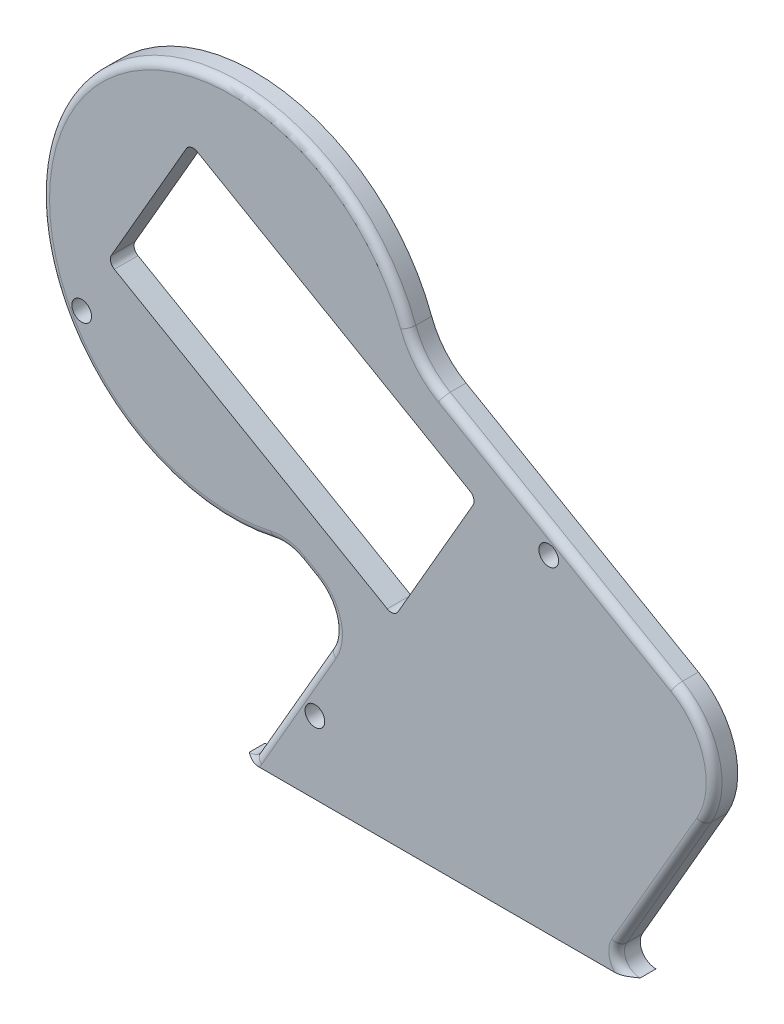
ISO-10303-21;
HEADER;
FILE_DESCRIPTION(('STEP AP214'),'2;1');
FILE_NAME('part.step','',(''),(''),'','','');
FILE_SCHEMA(('AUTOMOTIVE_DESIGN { 1 0 10303 214 1 1 1 1 }'));
ENDSEC;
DATA;
#1=APPLICATION_CONTEXT('core data for automotive mechanical design processes');
#2=APPLICATION_PROTOCOL_DEFINITION('international standard','automotive_design',2000,#1);
#3=PRODUCT_CONTEXT('',#1,'mechanical');
#4=PRODUCT('Part','Part','',(#3));
#5=PRODUCT_RELATED_PRODUCT_CATEGORY('part','',(#4));
#6=PRODUCT_DEFINITION_FORMATION('','',#4);
#7=PRODUCT_DEFINITION_CONTEXT('part definition',#1,'design');
#8=PRODUCT_DEFINITION('design','',#6,#7);
#9=PRODUCT_DEFINITION_SHAPE('','',#8);
#10=(LENGTH_UNIT() NAMED_UNIT(*) SI_UNIT(.MILLI.,.METRE.));
#11=(NAMED_UNIT(*) PLANE_ANGLE_UNIT() SI_UNIT($,.RADIAN.));
#12=(NAMED_UNIT(*) SI_UNIT($,.STERADIAN.) SOLID_ANGLE_UNIT());
#13=UNCERTAINTY_MEASURE_WITH_UNIT(LENGTH_MEASURE(1.E-05),#10,'distance_accuracy_value','');
#14=(GEOMETRIC_REPRESENTATION_CONTEXT(3) GLOBAL_UNCERTAINTY_ASSIGNED_CONTEXT((#13)) GLOBAL_UNIT_ASSIGNED_CONTEXT((#10,
#11,#12)) REPRESENTATION_CONTEXT('',''));
#15=CARTESIAN_POINT('',(0.,0.,0.));
#16=DIRECTION('',(0.,0.,1.));
#17=DIRECTION('',(1.,0.,0.));
#18=AXIS2_PLACEMENT_3D('',#15,#16,#17);
#19=CARTESIAN_POINT('',(6.85782905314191,60.9925358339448,3.));
#20=DIRECTION('',(0.,0.,1.));
#21=DIRECTION('',(1.,0.,0.));
#22=AXIS2_PLACEMENT_3D('',#19,#20,#21);
#23=PLANE('',#22);
#24=CARTESIAN_POINT('',(-43.9149447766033,38.8935845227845,3.));
#25=DIRECTION('',(0.,0.,1.));
#26=DIRECTION('',(1.,0.,0.));
#27=AXIS2_PLACEMENT_3D('',#24,#25,#26);
#28=CIRCLE('',#27,1.24999999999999);
#29=CARTESIAN_POINT('',(-42.6649447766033,38.8935845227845,3.));
#30=VERTEX_POINT('',#29);
#31=EDGE_CURVE('E472',#30,#30,#28,.T.);
#32=ORIENTED_EDGE('',*,*,#31,.F.);
#33=EDGE_LOOP('',(#32));
#34=FACE_BOUND('',#33,.T.);
#35=CARTESIAN_POINT('',(15.3487875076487,41.6565219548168,3.));
#36=DIRECTION('',(0.,0.,1.));
#37=DIRECTION('',(1.,0.,0.));
#38=AXIS2_PLACEMENT_3D('',#35,#36,#37);
#39=CIRCLE('',#38,1.24999999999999);
#40=CARTESIAN_POINT('',(16.5987875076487,41.6565219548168,3.));
#41=VERTEX_POINT('',#40);
#42=EDGE_CURVE('E484',#41,#41,#39,.T.);
#43=ORIENTED_EDGE('',*,*,#42,.F.);
#44=EDGE_LOOP('',(#43));
#45=FACE_BOUND('',#44,.T.);
#46=CARTESIAN_POINT('',(-14.3245735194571,9.16025403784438,3.));
#47=DIRECTION('',(0.,0.,1.));
#48=DIRECTION('',(1.,0.,0.));
#49=AXIS2_PLACEMENT_3D('',#46,#47,#48);
#50=CIRCLE('',#49,1.24999999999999);
#51=CARTESIAN_POINT('',(-13.0745735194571,9.16025403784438,3.));
#52=VERTEX_POINT('',#51);
#53=EDGE_CURVE('E490',#52,#52,#50,.T.);
#54=ORIENTED_EDGE('',*,*,#53,.F.);
#55=EDGE_LOOP('',(#54));
#56=FACE_BOUND('',#55,.T.);
#57=DIRECTION('',(-1.,0.,0.));
#58=VECTOR('',#57,1.);
#59=CARTESIAN_POINT('',(25.9641016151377,0.,3.));
#60=LINE('',#59,#58);
#61=CARTESIAN_POINT('',(23.7280336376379,0.,3.));
#62=VERTEX_POINT('',#61);
#63=CARTESIAN_POINT('',(-21.4186325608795,0.,3.));
#64=VERTEX_POINT('',#63);
#65=EDGE_CURVE('E218',#62,#64,#60,.T.);
#66=ORIENTED_EDGE('',*,*,#65,.F.);
#67=CARTESIAN_POINT('',(25.9641016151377,1.99999999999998,3.));
#68=DIRECTION('',(0.,0.,1.));
#69=DIRECTION('',(1.,0.,0.));
#70=AXIS2_PLACEMENT_3D('',#67,#68,#69);
#71=CIRCLE('',#70,3.);
#72=CARTESIAN_POINT('',(23.3660254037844,3.49999999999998,3.));
#73=VERTEX_POINT('',#72);
#74=EDGE_CURVE('E823',#62,#73,#71,.F.);
#75=ORIENTED_EDGE('',*,*,#74,.T.);
#76=DIRECTION('',(-0.499999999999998,-0.86602540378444,0.));
#77=VECTOR('',#76,1.);
#78=CARTESIAN_POINT('',(44.1339745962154,39.4711431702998,3.));
#79=LINE('',#78,#77);
#80=CARTESIAN_POINT('',(34.1339745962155,22.150635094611,3.));
#81=VERTEX_POINT('',#80);
#82=EDGE_CURVE('E822',#73,#81,#79,.F.);
#83=ORIENTED_EDGE('',*,*,#82,.T.);
#84=CARTESIAN_POINT('',(26.3397459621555,26.650635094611,3.));
#85=DIRECTION('',(0.,0.,1.));
#86=DIRECTION('',(1.,0.,0.));
#87=AXIS2_PLACEMENT_3D('',#84,#85,#86);
#88=CIRCLE('',#87,9.);
#89=CARTESIAN_POINT('',(30.8397459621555,34.4448637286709,3.));
#90=VERTEX_POINT('',#89);
#91=EDGE_CURVE('E842',#81,#90,#88,.T.);
#92=ORIENTED_EDGE('',*,*,#91,.T.);
#93=DIRECTION('',(0.86602540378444,-0.499999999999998,0.));
#94=VECTOR('',#93,1.);
#95=CARTESIAN_POINT('',(1.35782905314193,51.466256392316,3.));
#96=LINE('',#95,#94);
#97=CARTESIAN_POINT('',(1.35782905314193,51.466256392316,3.));
#98=VERTEX_POINT('',#97);
#99=EDGE_CURVE('E840',#90,#98,#96,.F.);
#100=ORIENTED_EDGE('',*,*,#99,.T.);
#101=CARTESIAN_POINT('',(6.85782905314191,60.9925358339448,3.));
#102=DIRECTION('',(0.,0.,1.));
#103=DIRECTION('',(1.,0.,0.));
#104=AXIS2_PLACEMENT_3D('',#101,#102,#103);
#105=CIRCLE('',#104,11.);
#106=CARTESIAN_POINT('',(-3.44911564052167,57.1497645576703,3.));
#107=VERTEX_POINT('',#106);
#108=EDGE_CURVE('E838',#98,#107,#105,.F.);
#109=ORIENTED_EDGE('',*,*,#108,.T.);
#110=CARTESIAN_POINT('',(-25.0000000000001,49.1148791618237,3.));
#111=DIRECTION('',(0.,0.,1.));
#112=DIRECTION('',(1.,0.,0.));
#113=AXIS2_PLACEMENT_3D('',#110,#111,#112);
#114=CIRCLE('',#113,23.);
#115=CARTESIAN_POINT('',(-19.9118612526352,26.6847466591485,3.));
#116=VERTEX_POINT('',#115);
#117=EDGE_CURVE('E824',#107,#116,#114,.T.);
#118=ORIENTED_EDGE('',*,*,#117,.T.);
#119=CARTESIAN_POINT('',(-18.5845207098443,20.8334077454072,3.));
#120=DIRECTION('',(0.,0.,1.));
#121=DIRECTION('',(1.,0.,0.));
#122=AXIS2_PLACEMENT_3D('',#119,#120,#121);
#123=CIRCLE('',#122,6.00000000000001);
#124=CARTESIAN_POINT('',(-15.5845207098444,26.0295601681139,3.));
#125=VERTEX_POINT('',#124);
#126=EDGE_CURVE('E825',#116,#125,#123,.F.);
#127=ORIENTED_EDGE('',*,*,#126,.T.);
#128=DIRECTION('',(-0.866025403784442,0.499999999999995,0.));
#129=VECTOR('',#128,1.);
#130=CARTESIAN_POINT('',(-13.8921709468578,25.0524815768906,3.));
#131=LINE('',#130,#129);
#132=CARTESIAN_POINT('',(-13.8301270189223,25.0166604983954,3.));
#133=VERTEX_POINT('',#132);
#134=EDGE_CURVE('E828',#125,#133,#131,.F.);
#135=ORIENTED_EDGE('',*,*,#134,.T.);
#136=CARTESIAN_POINT('',(-16.8301270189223,19.8205080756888,3.));
#137=DIRECTION('',(0.,0.,1.));
#138=DIRECTION('',(1.,0.,0.));
#139=AXIS2_PLACEMENT_3D('',#136,#137,#138);
#140=CIRCLE('',#139,6.);
#141=CARTESIAN_POINT('',(-11.6339745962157,16.8205080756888,3.));
#142=VERTEX_POINT('',#141);
#143=EDGE_CURVE('E832',#133,#142,#140,.F.);
#144=ORIENTED_EDGE('',*,*,#143,.T.);
#145=DIRECTION('',(0.499999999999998,0.86602540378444,0.));
#146=VECTOR('',#145,1.);
#147=CARTESIAN_POINT('',(12.1160254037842,57.9567147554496,3.));
#148=LINE('',#147,#146);
#149=CARTESIAN_POINT('',(-21.056624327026,0.499999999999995,3.));
#150=VERTEX_POINT('',#149);
#151=EDGE_CURVE('E834',#142,#150,#148,.F.);
#152=ORIENTED_EDGE('',*,*,#151,.T.);
#153=CARTESIAN_POINT('',(-23.6547005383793,1.99999999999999,3.));
#154=DIRECTION('',(0.,0.,1.));
#155=DIRECTION('',(1.,0.,0.));
#156=AXIS2_PLACEMENT_3D('',#153,#154,#155);
#157=CIRCLE('',#156,3.);
#158=EDGE_CURVE('E836',#150,#64,#157,.F.);
#159=ORIENTED_EDGE('',*,*,#158,.T.);
#160=EDGE_LOOP('',(#66,#75,#83,#92,#100,#109,#118,#127,#135,#144,#152,#159));
#161=FACE_BOUND('',#160,.T.);
#162=DIRECTION('',(0.866025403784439,-0.5,0.));
#163=VECTOR('',#162,1.);
#164=CARTESIAN_POINT('',(-0.9998044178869,47.3827154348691,3.));
#165=LINE('',#164,#163);
#166=CARTESIAN_POINT('',(-29.2762794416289,63.7081459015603,3.));
#167=VERTEX_POINT('',#166);
#168=CARTESIAN_POINT('',(5.36473670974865,43.7081459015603,3.));
#169=VERTEX_POINT('',#168);
#170=EDGE_CURVE('E478',#167,#169,#165,.T.);
#171=ORIENTED_EDGE('',*,*,#170,.T.);
#172=CARTESIAN_POINT('',(4.86473670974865,42.8421204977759,3.));
#173=DIRECTION('',(0.,0.,1.));
#174=DIRECTION('',(1.,0.,0.));
#175=AXIS2_PLACEMENT_3D('',#172,#173,#174);
#176=CIRCLE('',#175,1.);
#177=CARTESIAN_POINT('',(5.73076211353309,42.3421204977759,3.));
#178=VERTEX_POINT('',#177);
#179=EDGE_CURVE('E450',#169,#178,#176,.F.);
#180=ORIENTED_EDGE('',*,*,#179,.T.);
#181=DIRECTION('',(-0.5,-0.866025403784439,0.));
#182=VECTOR('',#181,1.);
#183=CARTESIAN_POINT('',(14.0883955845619,56.817966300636,3.));
#184=LINE('',#183,#182);
#185=CARTESIAN_POINT('',(-3.76923788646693,25.8876378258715,3.));
#186=VERTEX_POINT('',#185);
#187=EDGE_CURVE('E473',#178,#186,#184,.T.);
#188=ORIENTED_EDGE('',*,*,#187,.T.);
#189=CARTESIAN_POINT('',(-4.63526329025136,26.3876378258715,3.));
#190=DIRECTION('',(0.,0.,1.));
#191=DIRECTION('',(1.,0.,0.));
#192=AXIS2_PLACEMENT_3D('',#189,#190,#191);
#193=CIRCLE('',#192,1.);
#194=CARTESIAN_POINT('',(-5.13526329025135,25.5216124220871,3.));
#195=VERTEX_POINT('',#194);
#196=EDGE_CURVE('E11',#186,#195,#193,.F.);
#197=ORIENTED_EDGE('',*,*,#196,.T.);
#198=DIRECTION('',(-0.866025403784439,0.5,0.));
#199=VECTOR('',#198,1.);
#200=CARTESIAN_POINT('',(-11.4998044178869,29.1961819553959,3.));
#201=LINE('',#200,#199);
#202=CARTESIAN_POINT('',(-39.7762794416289,45.5216124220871,3.));
#203=VERTEX_POINT('',#202);
#204=EDGE_CURVE('E471',#195,#203,#201,.T.);
#205=ORIENTED_EDGE('',*,*,#204,.T.);
#206=CARTESIAN_POINT('',(-39.2762794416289,46.3876378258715,3.));
#207=DIRECTION('',(0.,0.,1.));
#208=DIRECTION('',(1.,0.,0.));
#209=AXIS2_PLACEMENT_3D('',#206,#207,#208);
#210=CIRCLE('',#209,1.);
#211=CARTESIAN_POINT('',(-40.1423048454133,46.8876378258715,3.));
#212=VERTEX_POINT('',#211);
#213=EDGE_CURVE('E454',#203,#212,#210,.F.);
#214=ORIENTED_EDGE('',*,*,#213,.T.);
#215=DIRECTION('',(0.5,0.866025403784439,0.));
#216=VECTOR('',#215,1.);
#217=CARTESIAN_POINT('',(-22.2846713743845,77.817966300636,3.));
#218=LINE('',#217,#216);
#219=CARTESIAN_POINT('',(-30.6423048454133,63.3421204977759,3.));
#220=VERTEX_POINT('',#219);
#221=EDGE_CURVE('E513',#212,#220,#218,.T.);
#222=ORIENTED_EDGE('',*,*,#221,.T.);
#223=CARTESIAN_POINT('',(-29.7762794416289,62.8421204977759,3.));
#224=DIRECTION('',(0.,0.,1.));
#225=DIRECTION('',(1.,0.,0.));
#226=AXIS2_PLACEMENT_3D('',#223,#224,#225);
#227=CIRCLE('',#226,1.);
#228=EDGE_CURVE('E446',#220,#167,#227,.F.);
#229=ORIENTED_EDGE('',*,*,#228,.T.);
#230=EDGE_LOOP('',(#171,#180,#188,#197,#205,#214,#222,#229));
#231=FACE_BOUND('',#230,.T.);
#232=ADVANCED_FACE('F34',(#34,#45,#56,#161,#231),#23,.T.);
#233=CARTESIAN_POINT('',(6.85782905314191,60.9925358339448,0.));
#234=DIRECTION('',(0.,0.,1.));
#235=DIRECTION('',(1.,0.,0.));
#236=AXIS2_PLACEMENT_3D('',#233,#234,#235);
#237=PLANE('',#236);
#238=CARTESIAN_POINT('',(6.85782905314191,60.9925358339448,0.));
#239=DIRECTION('',(0.,0.,1.));
#240=DIRECTION('',(1.,0.,0.));
#241=AXIS2_PLACEMENT_3D('',#238,#239,#240);
#242=CIRCLE('',#241,10.);
#243=CARTESIAN_POINT('',(-2.51212066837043,57.499107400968,0.));
#244=VERTEX_POINT('',#243);
#245=CARTESIAN_POINT('',(1.85782905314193,52.3322817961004,0.));
#246=VERTEX_POINT('',#245);
#247=EDGE_CURVE('E212',#244,#246,#242,.T.);
#248=ORIENTED_EDGE('',*,*,#247,.T.);
#249=DIRECTION('',(0.86602540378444,-0.499999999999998,0.));
#250=VECTOR('',#249,1.);
#251=CARTESIAN_POINT('',(1.85782905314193,52.3322817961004,0.));
#252=LINE('',#251,#250);
#253=CARTESIAN_POINT('',(31.3397459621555,35.3108891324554,0.));
#254=VERTEX_POINT('',#253);
#255=EDGE_CURVE('E221',#246,#254,#252,.T.);
#256=ORIENTED_EDGE('',*,*,#255,.T.);
#257=CARTESIAN_POINT('',(26.3397459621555,26.650635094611,0.));
#258=DIRECTION('',(0.,0.,1.));
#259=DIRECTION('',(1.,0.,0.));
#260=AXIS2_PLACEMENT_3D('',#257,#258,#259);
#261=CIRCLE('',#260,10.);
#262=CARTESIAN_POINT('',(34.9999999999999,21.650635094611,0.));
#263=VERTEX_POINT('',#262);
#264=EDGE_CURVE('E227',#263,#254,#261,.T.);
#265=ORIENTED_EDGE('',*,*,#264,.F.);
#266=DIRECTION('',(-0.499999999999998,-0.86602540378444,0.));
#267=VECTOR('',#266,1.);
#268=CARTESIAN_POINT('',(34.9999999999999,21.650635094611,0.));
#269=LINE('',#268,#267);
#270=CARTESIAN_POINT('',(24.2320508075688,2.99999999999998,0.));
#271=VERTEX_POINT('',#270);
#272=EDGE_CURVE('E244',#263,#271,#269,.T.);
#273=ORIENTED_EDGE('',*,*,#272,.T.);
#274=CARTESIAN_POINT('',(25.9641016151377,1.99999999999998,0.));
#275=DIRECTION('',(0.,0.,1.));
#276=DIRECTION('',(1.,0.,0.));
#277=AXIS2_PLACEMENT_3D('',#274,#275,#276);
#278=CIRCLE('',#277,2.);
#279=CARTESIAN_POINT('',(25.9641016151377,0.,0.));
#280=VERTEX_POINT('',#279);
#281=EDGE_CURVE('E247',#271,#280,#278,.T.);
#282=ORIENTED_EDGE('',*,*,#281,.T.);
#283=DIRECTION('',(-1.,0.,0.));
#284=VECTOR('',#283,1.);
#285=CARTESIAN_POINT('',(25.9641016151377,0.,0.));
#286=LINE('',#285,#284);
#287=CARTESIAN_POINT('',(-23.6547005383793,0.,0.));
#288=VERTEX_POINT('',#287);
#289=EDGE_CURVE('E250',#280,#288,#286,.T.);
#290=ORIENTED_EDGE('',*,*,#289,.T.);
#291=CARTESIAN_POINT('',(-23.6547005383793,1.99999999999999,0.));
#292=DIRECTION('',(0.,0.,1.));
#293=DIRECTION('',(1.,0.,0.));
#294=AXIS2_PLACEMENT_3D('',#291,#292,#293);
#295=CIRCLE('',#294,2.);
#296=CARTESIAN_POINT('',(-21.9226497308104,0.999999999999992,0.));
#297=VERTEX_POINT('',#296);
#298=EDGE_CURVE('E253',#288,#297,#295,.T.);
#299=ORIENTED_EDGE('',*,*,#298,.T.);
#300=DIRECTION('',(0.499999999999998,0.86602540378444,0.));
#301=VECTOR('',#300,1.);
#302=CARTESIAN_POINT('',(-21.9226497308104,0.999999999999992,0.));
#303=LINE('',#302,#301);
#304=CARTESIAN_POINT('',(-12.5000000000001,17.3205080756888,0.));
#305=VERTEX_POINT('',#304);
#306=EDGE_CURVE('E256',#297,#305,#303,.T.);
#307=ORIENTED_EDGE('',*,*,#306,.T.);
#308=CARTESIAN_POINT('',(-16.8301270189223,19.8205080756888,0.));
#309=DIRECTION('',(0.,0.,1.));
#310=DIRECTION('',(1.,0.,0.));
#311=AXIS2_PLACEMENT_3D('',#308,#309,#310);
#312=CIRCLE('',#311,5.);
#313=CARTESIAN_POINT('',(-14.3301270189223,24.150635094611,0.));
#314=VERTEX_POINT('',#313);
#315=EDGE_CURVE('E259',#305,#314,#312,.T.);
#316=ORIENTED_EDGE('',*,*,#315,.T.);
#317=DIRECTION('',(-0.866025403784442,0.499999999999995,0.));
#318=VECTOR('',#317,1.);
#319=CARTESIAN_POINT('',(-14.3301270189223,24.150635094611,0.));
#320=LINE('',#319,#318);
#321=CARTESIAN_POINT('',(-16.0845207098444,25.1635347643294,0.));
#322=VERTEX_POINT('',#321);
#323=EDGE_CURVE('E262',#314,#322,#320,.T.);
#324=ORIENTED_EDGE('',*,*,#323,.T.);
#325=CARTESIAN_POINT('',(-18.5845207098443,20.8334077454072,0.));
#326=DIRECTION('',(0.,0.,1.));
#327=DIRECTION('',(1.,0.,0.));
#328=AXIS2_PLACEMENT_3D('',#325,#326,#327);
#329=CIRCLE('',#328,5.00000000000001);
#330=CARTESIAN_POINT('',(-19.6906378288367,25.7095235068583,0.));
#331=VERTEX_POINT('',#330);
#332=EDGE_CURVE('E265',#322,#331,#329,.T.);
#333=ORIENTED_EDGE('',*,*,#332,.T.);
#334=CARTESIAN_POINT('',(-25.0000000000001,49.1148791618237,0.));
#335=DIRECTION('',(0.,0.,1.));
#336=DIRECTION('',(1.,0.,0.));
#337=AXIS2_PLACEMENT_3D('',#334,#335,#336);
#338=CIRCLE('',#337,24.);
#339=EDGE_CURVE('E234',#244,#331,#338,.T.);
#340=ORIENTED_EDGE('',*,*,#339,.F.);
#341=EDGE_LOOP('',(#248,#256,#265,#273,#282,#290,#299,#307,#316,#324,#333,#340));
#342=FACE_BOUND('',#341,.T.);
#343=CARTESIAN_POINT('',(-14.3245735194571,9.16025403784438,0.));
#344=DIRECTION('',(0.,0.,1.));
#345=DIRECTION('',(1.,0.,0.));
#346=AXIS2_PLACEMENT_3D('',#343,#344,#345);
#347=CIRCLE('',#346,1.24999999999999);
#348=CARTESIAN_POINT('',(-13.0745735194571,9.16025403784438,0.));
#349=VERTEX_POINT('',#348);
#350=EDGE_CURVE('E403',#349,#349,#347,.T.);
#351=ORIENTED_EDGE('',*,*,#350,.T.);
#352=EDGE_LOOP('',(#351));
#353=FACE_BOUND('',#352,.T.);
#354=CARTESIAN_POINT('',(15.3487875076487,41.6565219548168,0.));
#355=DIRECTION('',(0.,0.,1.));
#356=DIRECTION('',(1.,0.,0.));
#357=AXIS2_PLACEMENT_3D('',#354,#355,#356);
#358=CIRCLE('',#357,1.24999999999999);
#359=CARTESIAN_POINT('',(16.5987875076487,41.6565219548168,0.));
#360=VERTEX_POINT('',#359);
#361=EDGE_CURVE('E487',#360,#360,#358,.T.);
#362=ORIENTED_EDGE('',*,*,#361,.T.);
#363=EDGE_LOOP('',(#362));
#364=FACE_BOUND('',#363,.T.);
#365=CARTESIAN_POINT('',(-43.9149447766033,38.8935845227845,0.));
#366=DIRECTION('',(0.,0.,1.));
#367=DIRECTION('',(1.,0.,0.));
#368=AXIS2_PLACEMENT_3D('',#365,#366,#367);
#369=CIRCLE('',#368,1.24999999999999);
#370=CARTESIAN_POINT('',(-42.6649447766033,38.8935845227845,0.));
#371=VERTEX_POINT('',#370);
#372=EDGE_CURVE('E476',#371,#371,#369,.T.);
#373=ORIENTED_EDGE('',*,*,#372,.T.);
#374=EDGE_LOOP('',(#373));
#375=FACE_BOUND('',#374,.T.);
#376=DIRECTION('',(-0.5,-0.866025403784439,0.));
#377=VECTOR('',#376,1.);
#378=CARTESIAN_POINT('',(-22.2846713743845,77.817966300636,0.));
#379=LINE('',#378,#377);
#380=CARTESIAN_POINT('',(-30.6423048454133,63.3421204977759,0.));
#381=VERTEX_POINT('',#380);
#382=CARTESIAN_POINT('',(-40.1423048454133,46.8876378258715,0.));
#383=VERTEX_POINT('',#382);
#384=EDGE_CURVE('E518',#381,#383,#379,.T.);
#385=ORIENTED_EDGE('',*,*,#384,.T.);
#386=CARTESIAN_POINT('',(-39.2762794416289,46.3876378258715,0.));
#387=DIRECTION('',(0.,0.,1.));
#388=DIRECTION('',(1.,0.,0.));
#389=AXIS2_PLACEMENT_3D('',#386,#387,#388);
#390=CIRCLE('',#389,1.);
#391=CARTESIAN_POINT('',(-39.7762794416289,45.5216124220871,0.));
#392=VERTEX_POINT('',#391);
#393=EDGE_CURVE('E452',#383,#392,#390,.T.);
#394=ORIENTED_EDGE('',*,*,#393,.T.);
#395=DIRECTION('',(0.866025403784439,-0.5,0.));
#396=VECTOR('',#395,1.);
#397=CARTESIAN_POINT('',(-11.4998044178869,29.1961819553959,0.));
#398=LINE('',#397,#396);
#399=CARTESIAN_POINT('',(-5.13526329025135,25.5216124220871,0.));
#400=VERTEX_POINT('',#399);
#401=EDGE_CURVE('E461',#392,#400,#398,.T.);
#402=ORIENTED_EDGE('',*,*,#401,.T.);
#403=CARTESIAN_POINT('',(-4.63526329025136,26.3876378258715,0.));
#404=DIRECTION('',(0.,0.,1.));
#405=DIRECTION('',(1.,0.,0.));
#406=AXIS2_PLACEMENT_3D('',#403,#404,#405);
#407=CIRCLE('',#406,1.);
#408=CARTESIAN_POINT('',(-3.76923788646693,25.8876378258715,0.));
#409=VERTEX_POINT('',#408);
#410=EDGE_CURVE('E42',#400,#409,#407,.T.);
#411=ORIENTED_EDGE('',*,*,#410,.T.);
#412=DIRECTION('',(0.5,0.866025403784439,0.));
#413=VECTOR('',#412,1.);
#414=CARTESIAN_POINT('',(14.0883955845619,56.817966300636,0.));
#415=LINE('',#414,#413);
#416=CARTESIAN_POINT('',(5.73076211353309,42.3421204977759,0.));
#417=VERTEX_POINT('',#416);
#418=EDGE_CURVE('E460',#409,#417,#415,.T.);
#419=ORIENTED_EDGE('',*,*,#418,.T.);
#420=CARTESIAN_POINT('',(4.86473670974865,42.8421204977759,0.));
#421=DIRECTION('',(0.,0.,1.));
#422=DIRECTION('',(1.,0.,0.));
#423=AXIS2_PLACEMENT_3D('',#420,#421,#422);
#424=CIRCLE('',#423,1.);
#425=CARTESIAN_POINT('',(5.36473670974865,43.7081459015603,0.));
#426=VERTEX_POINT('',#425);
#427=EDGE_CURVE('E448',#417,#426,#424,.T.);
#428=ORIENTED_EDGE('',*,*,#427,.T.);
#429=DIRECTION('',(-0.866025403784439,0.5,0.));
#430=VECTOR('',#429,1.);
#431=CARTESIAN_POINT('',(-0.9998044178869,47.3827154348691,0.));
#432=LINE('',#431,#430);
#433=CARTESIAN_POINT('',(-29.2762794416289,63.7081459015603,0.));
#434=VERTEX_POINT('',#433);
#435=EDGE_CURVE('E468',#426,#434,#432,.T.);
#436=ORIENTED_EDGE('',*,*,#435,.T.);
#437=CARTESIAN_POINT('',(-29.7762794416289,62.8421204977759,0.));
#438=DIRECTION('',(0.,0.,1.));
#439=DIRECTION('',(1.,0.,0.));
#440=AXIS2_PLACEMENT_3D('',#437,#438,#439);
#441=CIRCLE('',#440,1.);
#442=EDGE_CURVE('E444',#434,#381,#441,.T.);
#443=ORIENTED_EDGE('',*,*,#442,.T.);
#444=EDGE_LOOP('',(#385,#394,#402,#411,#419,#428,#436,#443));
#445=FACE_BOUND('',#444,.T.);
#446=ADVANCED_FACE('F230',(#342,#353,#364,#375,#445),#237,.F.);
#447=CARTESIAN_POINT('',(6.85782905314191,60.9925358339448,3.));
#448=DIRECTION('',(0.,0.,-1.));
#449=DIRECTION('',(-1.,0.,0.));
#450=AXIS2_PLACEMENT_3D('',#447,#448,#449);
#451=CYLINDRICAL_SURFACE('',#450,10.);
#452=DIRECTION('',(0.,0.,-1.));
#453=VECTOR('',#452,1.);
#454=CARTESIAN_POINT('',(-2.51212066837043,57.499107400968,3.));
#455=LINE('',#454,#453);
#456=CARTESIAN_POINT('',(-2.51212066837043,57.499107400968,2.));
#457=VERTEX_POINT('',#456);
#458=EDGE_CURVE('E268',#457,#244,#455,.T.);
#459=ORIENTED_EDGE('',*,*,#458,.F.);
#460=CARTESIAN_POINT('',(6.85782905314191,60.9925358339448,2.));
#461=DIRECTION('',(0.,0.,1.));
#462=DIRECTION('',(1.,0.,0.));
#463=AXIS2_PLACEMENT_3D('',#460,#461,#462);
#464=CIRCLE('',#463,10.);
#465=CARTESIAN_POINT('',(1.85782905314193,52.3322817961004,2.));
#466=VERTEX_POINT('',#465);
#467=EDGE_CURVE('E214',#457,#466,#464,.T.);
#468=ORIENTED_EDGE('',*,*,#467,.T.);
#469=DIRECTION('',(0.,0.,-1.));
#470=VECTOR('',#469,1.);
#471=CARTESIAN_POINT('',(1.85782905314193,52.3322817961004,3.));
#472=LINE('',#471,#470);
#473=EDGE_CURVE('E207',#466,#246,#472,.T.);
#474=ORIENTED_EDGE('',*,*,#473,.T.);
#475=ORIENTED_EDGE('',*,*,#247,.F.);
#476=EDGE_LOOP('',(#459,#468,#474,#475));
#477=FACE_BOUND('',#476,.T.);
#478=ADVANCED_FACE('F210',(#477),#451,.F.);
#479=CARTESIAN_POINT('',(-25.0000000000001,49.1148791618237,3.));
#480=DIRECTION('',(0.,0.,-1.));
#481=DIRECTION('',(-1.,0.,0.));
#482=AXIS2_PLACEMENT_3D('',#479,#480,#481);
#483=CYLINDRICAL_SURFACE('',#482,24.);
#484=DIRECTION('',(0.,0.,-1.));
#485=VECTOR('',#484,1.);
#486=CARTESIAN_POINT('',(-19.6906378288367,25.7095235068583,3.));
#487=LINE('',#486,#485);
#488=CARTESIAN_POINT('',(-19.6906378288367,25.7095235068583,2.));
#489=VERTEX_POINT('',#488);
#490=EDGE_CURVE('E271',#489,#331,#487,.T.);
#491=ORIENTED_EDGE('',*,*,#490,.F.);
#492=CARTESIAN_POINT('',(-25.0000000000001,49.1148791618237,2.));
#493=DIRECTION('',(0.,0.,1.));
#494=DIRECTION('',(1.,0.,0.));
#495=AXIS2_PLACEMENT_3D('',#492,#493,#494);
#496=CIRCLE('',#495,24.);
#497=EDGE_CURVE('E396',#489,#457,#496,.F.);
#498=ORIENTED_EDGE('',*,*,#497,.T.);
#499=ORIENTED_EDGE('',*,*,#458,.T.);
#500=ORIENTED_EDGE('',*,*,#339,.T.);
#501=EDGE_LOOP('',(#491,#498,#499,#500));
#502=FACE_BOUND('',#501,.T.);
#503=ADVANCED_FACE('F346',(#502),#483,.T.);
#504=CARTESIAN_POINT('',(-18.5845207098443,20.8334077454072,3.));
#505=DIRECTION('',(0.,0.,-1.));
#506=DIRECTION('',(-1.,0.,0.));
#507=AXIS2_PLACEMENT_3D('',#504,#505,#506);
#508=CYLINDRICAL_SURFACE('',#507,5.00000000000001);
#509=DIRECTION('',(0.,0.,-1.));
#510=VECTOR('',#509,1.);
#511=CARTESIAN_POINT('',(-16.0845207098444,25.1635347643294,3.));
#512=LINE('',#511,#510);
#513=CARTESIAN_POINT('',(-16.0845207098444,25.1635347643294,2.));
#514=VERTEX_POINT('',#513);
#515=EDGE_CURVE('E273',#514,#322,#512,.T.);
#516=ORIENTED_EDGE('',*,*,#515,.F.);
#517=CARTESIAN_POINT('',(-18.5845207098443,20.8334077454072,2.));
#518=DIRECTION('',(0.,0.,1.));
#519=DIRECTION('',(1.,0.,0.));
#520=AXIS2_PLACEMENT_3D('',#517,#518,#519);
#521=CIRCLE('',#520,5.00000000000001);
#522=EDGE_CURVE('E394',#514,#489,#521,.T.);
#523=ORIENTED_EDGE('',*,*,#522,.T.);
#524=ORIENTED_EDGE('',*,*,#490,.T.);
#525=ORIENTED_EDGE('',*,*,#332,.F.);
#526=EDGE_LOOP('',(#516,#523,#524,#525));
#527=FACE_BOUND('',#526,.T.);
#528=ADVANCED_FACE('F349',(#527),#508,.F.);
#529=CARTESIAN_POINT('',(-14.3301270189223,24.150635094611,3.));
#530=DIRECTION('',(-0.499999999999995,-0.866025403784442,0.));
#531=DIRECTION('',(0.866025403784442,-0.499999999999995,0.));
#532=AXIS2_PLACEMENT_3D('',#529,#530,#531);
#533=PLANE('',#532);
#534=DIRECTION('',(0.,0.,-1.));
#535=VECTOR('',#534,1.);
#536=CARTESIAN_POINT('',(-14.3301270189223,24.150635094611,3.));
#537=LINE('',#536,#535);
#538=CARTESIAN_POINT('',(-14.3301270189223,24.150635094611,2.));
#539=VERTEX_POINT('',#538);
#540=EDGE_CURVE('E275',#539,#314,#537,.T.);
#541=ORIENTED_EDGE('',*,*,#540,.F.);
#542=DIRECTION('',(-0.866025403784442,0.499999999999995,0.));
#543=VECTOR('',#542,1.);
#544=CARTESIAN_POINT('',(-14.3301270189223,24.150635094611,2.));
#545=LINE('',#544,#543);
#546=EDGE_CURVE('E392',#539,#514,#545,.T.);
#547=ORIENTED_EDGE('',*,*,#546,.T.);
#548=ORIENTED_EDGE('',*,*,#515,.T.);
#549=ORIENTED_EDGE('',*,*,#323,.F.);
#550=EDGE_LOOP('',(#541,#547,#548,#549));
#551=FACE_BOUND('',#550,.T.);
#552=ADVANCED_FACE('F353',(#551),#533,.T.);
#553=CARTESIAN_POINT('',(-16.8301270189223,19.8205080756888,3.));
#554=DIRECTION('',(0.,0.,-1.));
#555=DIRECTION('',(-1.,0.,0.));
#556=AXIS2_PLACEMENT_3D('',#553,#554,#555);
#557=CYLINDRICAL_SURFACE('',#556,5.);
#558=DIRECTION('',(0.,0.,-1.));
#559=VECTOR('',#558,1.);
#560=CARTESIAN_POINT('',(-12.5000000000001,17.3205080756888,3.));
#561=LINE('',#560,#559);
#562=CARTESIAN_POINT('',(-12.5000000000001,17.3205080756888,2.));
#563=VERTEX_POINT('',#562);
#564=EDGE_CURVE('E277',#563,#305,#561,.T.);
#565=ORIENTED_EDGE('',*,*,#564,.F.);
#566=CARTESIAN_POINT('',(-16.8301270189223,19.8205080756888,2.));
#567=DIRECTION('',(0.,0.,1.));
#568=DIRECTION('',(1.,0.,0.));
#569=AXIS2_PLACEMENT_3D('',#566,#567,#568);
#570=CIRCLE('',#569,5.);
#571=EDGE_CURVE('E385',#563,#539,#570,.T.);
#572=ORIENTED_EDGE('',*,*,#571,.T.);
#573=ORIENTED_EDGE('',*,*,#540,.T.);
#574=ORIENTED_EDGE('',*,*,#315,.F.);
#575=EDGE_LOOP('',(#565,#572,#573,#574));
#576=FACE_BOUND('',#575,.T.);
#577=ADVANCED_FACE('F357',(#576),#557,.F.);
#578=CARTESIAN_POINT('',(-21.9226497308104,0.999999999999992,3.));
#579=DIRECTION('',(-0.86602540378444,0.499999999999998,0.));
#580=DIRECTION('',(-0.499999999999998,-0.86602540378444,0.));
#581=AXIS2_PLACEMENT_3D('',#578,#579,#580);
#582=PLANE('',#581);
#583=DIRECTION('',(0.,0.,-1.));
#584=VECTOR('',#583,1.);
#585=CARTESIAN_POINT('',(-21.9226497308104,0.999999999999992,3.));
#586=LINE('',#585,#584);
#587=CARTESIAN_POINT('',(-21.9226497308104,0.999999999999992,2.));
#588=VERTEX_POINT('',#587);
#589=EDGE_CURVE('E279',#588,#297,#586,.T.);
#590=ORIENTED_EDGE('',*,*,#589,.F.);
#591=DIRECTION('',(0.499999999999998,0.86602540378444,0.));
#592=VECTOR('',#591,1.);
#593=CARTESIAN_POINT('',(-21.9226497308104,0.999999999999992,2.));
#594=LINE('',#593,#592);
#595=EDGE_CURVE('E383',#588,#563,#594,.T.);
#596=ORIENTED_EDGE('',*,*,#595,.T.);
#597=ORIENTED_EDGE('',*,*,#564,.T.);
#598=ORIENTED_EDGE('',*,*,#306,.F.);
#599=EDGE_LOOP('',(#590,#596,#597,#598));
#600=FACE_BOUND('',#599,.T.);
#601=ADVANCED_FACE('F361',(#600),#582,.T.);
#602=CARTESIAN_POINT('',(-23.6547005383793,1.99999999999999,3.));
#603=DIRECTION('',(0.,0.,-1.));
#604=DIRECTION('',(-1.,0.,0.));
#605=AXIS2_PLACEMENT_3D('',#602,#603,#604);
#606=CYLINDRICAL_SURFACE('',#605,2.);
#607=DIRECTION('',(0.,0.,-1.));
#608=VECTOR('',#607,1.);
#609=CARTESIAN_POINT('',(-23.6547005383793,0.,3.));
#610=LINE('',#609,#608);
#611=CARTESIAN_POINT('',(-23.6547005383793,0.,2.));
#612=VERTEX_POINT('',#611);
#613=EDGE_CURVE('E281',#612,#288,#610,.T.);
#614=ORIENTED_EDGE('',*,*,#613,.F.);
#615=CARTESIAN_POINT('',(-23.6547005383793,1.99999999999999,2.));
#616=DIRECTION('',(0.,0.,1.));
#617=DIRECTION('',(1.,0.,0.));
#618=AXIS2_PLACEMENT_3D('',#615,#616,#617);
#619=CIRCLE('',#618,2.);
#620=EDGE_CURVE('E376',#612,#588,#619,.T.);
#621=ORIENTED_EDGE('',*,*,#620,.T.);
#622=ORIENTED_EDGE('',*,*,#589,.T.);
#623=ORIENTED_EDGE('',*,*,#298,.F.);
#624=EDGE_LOOP('',(#614,#621,#622,#623));
#625=FACE_BOUND('',#624,.T.);
#626=ADVANCED_FACE('F364',(#625),#606,.F.);
#627=CARTESIAN_POINT('',(25.9641016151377,0.,3.));
#628=DIRECTION('',(0.,-1.,0.));
#629=DIRECTION('',(1.,0.,0.));
#630=AXIS2_PLACEMENT_3D('',#627,#628,#629);
#631=PLANE('',#630);
#632=DIRECTION('',(0.,0.,-1.));
#633=VECTOR('',#632,1.);
#634=CARTESIAN_POINT('',(25.9641016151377,0.,3.));
#635=LINE('',#634,#633);
#636=CARTESIAN_POINT('',(25.9641016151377,0.,2.));
#637=VERTEX_POINT('',#636);
#638=EDGE_CURVE('E283',#637,#280,#635,.T.);
#639=ORIENTED_EDGE('',*,*,#638,.F.);
#640=CARTESIAN_POINT('',(23.7280336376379,0.,3.));
#641=CARTESIAN_POINT('',(23.7874297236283,0.,2.9999948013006));
#642=CARTESIAN_POINT('',(23.8467548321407,0.,2.99706185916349));
#643=CARTESIAN_POINT('',(23.9648017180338,0.,2.98595676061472));
#644=CARTESIAN_POINT('',(24.023524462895,0.,2.97779506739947));
#645=CARTESIAN_POINT('',(24.1964997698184,0.,2.94671957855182));
#646=CARTESIAN_POINT('',(24.3095697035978,0.,2.9171718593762));
#647=CARTESIAN_POINT('',(24.5415615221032,0.,2.84098297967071));
#648=CARTESIAN_POINT('',(24.6600167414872,0.,2.79298303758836));
#649=CARTESIAN_POINT('',(24.8915203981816,0.,2.68520855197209));
#650=CARTESIAN_POINT('',(25.0045604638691,0.,2.62541646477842));
#651=CARTESIAN_POINT('',(25.3386264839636,0.,2.4332215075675));
#652=CARTESIAN_POINT('',(25.552541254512,0.,2.28882249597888));
#653=CARTESIAN_POINT('',(25.8282484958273,0.,2.09603907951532));
#654=CARTESIAN_POINT('',(25.8925223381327,0.,2.05061333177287));
#655=CARTESIAN_POINT('',(25.9592329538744,0.,2.00344266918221));
#656=CARTESIAN_POINT('',(25.9616672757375,0.,2.00172134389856));
#657=CARTESIAN_POINT('',(25.9641016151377,0.,2.));
#658=B_SPLINE_CURVE_WITH_KNOTS('',3,(#640,#641,#642,#643,#644,#645,#646,#647,#648,#649,#650,
#651,#652,#653,#654,#655,#656,#657),.UNSPECIFIED.,.F.,.F.,(4,2,2,2,2,2,2,2,4),(0.,
0.178006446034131,0.355657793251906,0.705002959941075,1.08758379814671,1.470738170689,
2.24361312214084,2.47977972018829,2.48872399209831),.UNSPECIFIED.);
#659=EDGE_CURVE('E299',#637,#62,#658,.F.);
#660=ORIENTED_EDGE('',*,*,#659,.T.);
#661=ORIENTED_EDGE('',*,*,#65,.T.);
#662=CARTESIAN_POINT('',(-21.4186325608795,0.,3.));
#663=CARTESIAN_POINT('',(-21.4780286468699,0.,2.9999948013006));
#664=CARTESIAN_POINT('',(-21.5373537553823,0.,2.9970618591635));
#665=CARTESIAN_POINT('',(-21.6554006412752,0.,2.98595676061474));
#666=CARTESIAN_POINT('',(-21.7141233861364,0.,2.9777950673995));
#667=CARTESIAN_POINT('',(-21.8870986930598,0.,2.94671957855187));
#668=CARTESIAN_POINT('',(-22.0001686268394,0.,2.91717185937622));
#669=CARTESIAN_POINT('',(-22.2321604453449,0.,2.84098297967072));
#670=CARTESIAN_POINT('',(-22.3506156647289,0.,2.79298303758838));
#671=CARTESIAN_POINT('',(-22.5821193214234,0.,2.68520855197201));
#672=CARTESIAN_POINT('',(-22.6951593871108,0.,2.62541646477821));
#673=CARTESIAN_POINT('',(-23.0292254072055,0.,2.43322150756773));
#674=CARTESIAN_POINT('',(-23.2431401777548,0.,2.28882249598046));
#675=CARTESIAN_POINT('',(-23.5188474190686,0.,2.09603907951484));
#676=CARTESIAN_POINT('',(-23.5831212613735,0.,2.05061333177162));
#677=CARTESIAN_POINT('',(-23.6498318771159,0.,2.00344266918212));
#678=CARTESIAN_POINT('',(-23.6522661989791,0.,2.00172134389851));
#679=CARTESIAN_POINT('',(-23.6547005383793,0.,2.));
#680=B_SPLINE_CURVE_WITH_KNOTS('',3,(#662,#663,#664,#665,#666,#667,#668,#669,#670,#671,#672,
#673,#674,#675,#676,#677,#678,#679),.UNSPECIFIED.,.F.,.F.,(4,2,2,2,2,2,2,2,4),(0.,
0.178006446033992,0.355657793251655,0.705002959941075,1.08758379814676,1.47073817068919,
2.2436131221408,2.47977972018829,2.48872399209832),.UNSPECIFIED.);
#681=EDGE_CURVE('E292',#64,#612,#680,.T.);
#682=ORIENTED_EDGE('',*,*,#681,.T.);
#683=ORIENTED_EDGE('',*,*,#613,.T.);
#684=ORIENTED_EDGE('',*,*,#289,.F.);
#685=EDGE_LOOP('',(#639,#660,#661,#682,#683,#684));
#686=FACE_BOUND('',#685,.T.);
#687=ADVANCED_FACE('F305',(#686),#631,.T.);
#688=CARTESIAN_POINT('',(25.9641016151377,1.99999999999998,3.));
#689=DIRECTION('',(0.,0.,-1.));
#690=DIRECTION('',(-1.,0.,0.));
#691=AXIS2_PLACEMENT_3D('',#688,#689,#690);
#692=CYLINDRICAL_SURFACE('',#691,2.);
#693=DIRECTION('',(0.,0.,-1.));
#694=VECTOR('',#693,1.);
#695=CARTESIAN_POINT('',(24.2320508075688,2.99999999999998,3.));
#696=LINE('',#695,#694);
#697=CARTESIAN_POINT('',(24.2320508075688,2.99999999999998,2.));
#698=VERTEX_POINT('',#697);
#699=EDGE_CURVE('E285',#698,#271,#696,.T.);
#700=ORIENTED_EDGE('',*,*,#699,.F.);
#701=CARTESIAN_POINT('',(25.9641016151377,1.99999999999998,2.));
#702=DIRECTION('',(0.,0.,1.));
#703=DIRECTION('',(1.,0.,0.));
#704=AXIS2_PLACEMENT_3D('',#701,#702,#703);
#705=CIRCLE('',#704,2.);
#706=EDGE_CURVE('E270',#698,#637,#705,.T.);
#707=ORIENTED_EDGE('',*,*,#706,.T.);
#708=ORIENTED_EDGE('',*,*,#638,.T.);
#709=ORIENTED_EDGE('',*,*,#281,.F.);
#710=EDGE_LOOP('',(#700,#707,#708,#709));
#711=FACE_BOUND('',#710,.T.);
#712=ADVANCED_FACE('F371',(#711),#692,.F.);
#713=CARTESIAN_POINT('',(34.9999999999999,21.650635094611,3.));
#714=DIRECTION('',(0.86602540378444,-0.499999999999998,0.));
#715=DIRECTION('',(0.499999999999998,0.86602540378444,0.));
#716=AXIS2_PLACEMENT_3D('',#713,#714,#715);
#717=PLANE('',#716);
#718=DIRECTION('',(0.,0.,-1.));
#719=VECTOR('',#718,1.);
#720=CARTESIAN_POINT('',(34.9999999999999,21.650635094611,3.));
#721=LINE('',#720,#719);
#722=CARTESIAN_POINT('',(34.9999999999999,21.650635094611,2.));
#723=VERTEX_POINT('',#722);
#724=EDGE_CURVE('E287',#723,#263,#721,.T.);
#725=ORIENTED_EDGE('',*,*,#724,.F.);
#726=DIRECTION('',(-0.499999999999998,-0.86602540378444,0.));
#727=VECTOR('',#726,1.);
#728=CARTESIAN_POINT('',(34.9999999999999,21.650635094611,2.));
#729=LINE('',#728,#727);
#730=EDGE_CURVE('E821',#723,#698,#729,.T.);
#731=ORIENTED_EDGE('',*,*,#730,.T.);
#732=ORIENTED_EDGE('',*,*,#699,.T.);
#733=ORIENTED_EDGE('',*,*,#272,.F.);
#734=EDGE_LOOP('',(#725,#731,#732,#733));
#735=FACE_BOUND('',#734,.T.);
#736=ADVANCED_FACE('F730',(#735),#717,.T.);
#737=CARTESIAN_POINT('',(26.3397459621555,26.650635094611,3.));
#738=DIRECTION('',(0.,0.,-1.));
#739=DIRECTION('',(-1.,0.,0.));
#740=AXIS2_PLACEMENT_3D('',#737,#738,#739);
#741=CYLINDRICAL_SURFACE('',#740,10.);
#742=DIRECTION('',(0.,0.,-1.));
#743=VECTOR('',#742,1.);
#744=CARTESIAN_POINT('',(31.3397459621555,35.3108891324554,3.));
#745=LINE('',#744,#743);
#746=CARTESIAN_POINT('',(31.3397459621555,35.3108891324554,2.));
#747=VERTEX_POINT('',#746);
#748=EDGE_CURVE('E217',#747,#254,#745,.T.);
#749=ORIENTED_EDGE('',*,*,#748,.F.);
#750=CARTESIAN_POINT('',(26.3397459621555,26.650635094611,2.));
#751=DIRECTION('',(0.,0.,1.));
#752=DIRECTION('',(1.,0.,0.));
#753=AXIS2_PLACEMENT_3D('',#750,#751,#752);
#754=CIRCLE('',#753,10.);
#755=EDGE_CURVE('E847',#747,#723,#754,.F.);
#756=ORIENTED_EDGE('',*,*,#755,.T.);
#757=ORIENTED_EDGE('',*,*,#724,.T.);
#758=ORIENTED_EDGE('',*,*,#264,.T.);
#759=EDGE_LOOP('',(#749,#756,#757,#758));
#760=FACE_BOUND('',#759,.T.);
#761=ADVANCED_FACE('F722',(#760),#741,.T.);
#762=CARTESIAN_POINT('',(1.85782905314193,52.3322817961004,3.));
#763=DIRECTION('',(0.499999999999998,0.86602540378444,0.));
#764=DIRECTION('',(-0.86602540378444,0.499999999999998,0.));
#765=AXIS2_PLACEMENT_3D('',#762,#763,#764);
#766=PLANE('',#765);
#767=ORIENTED_EDGE('',*,*,#473,.F.);
#768=DIRECTION('',(0.86602540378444,-0.499999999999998,0.));
#769=VECTOR('',#768,1.);
#770=CARTESIAN_POINT('',(1.85782905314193,52.3322817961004,2.));
#771=LINE('',#770,#769);
#772=EDGE_CURVE('E387',#466,#747,#771,.T.);
#773=ORIENTED_EDGE('',*,*,#772,.T.);
#774=ORIENTED_EDGE('',*,*,#748,.T.);
#775=ORIENTED_EDGE('',*,*,#255,.F.);
#776=EDGE_LOOP('',(#767,#773,#774,#775));
#777=FACE_BOUND('',#776,.T.);
#778=ADVANCED_FACE('F222',(#777),#766,.T.);
#779=CARTESIAN_POINT('',(-23.6547005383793,1.99999999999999,2.));
#780=DIRECTION('',(0.,0.,1.));
#781=DIRECTION('',(1.,0.,0.));
#782=AXIS2_PLACEMENT_3D('',#779,#780,#781);
#783=TOROIDAL_SURFACE('',#782,3.,1.);
#784=ORIENTED_EDGE('',*,*,#681,.F.);
#785=ORIENTED_EDGE('',*,*,#158,.F.);
#786=CARTESIAN_POINT('',(-21.056624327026,0.499999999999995,2.));
#787=DIRECTION('',(0.499999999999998,0.86602540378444,0.));
#788=DIRECTION('',(-0.86602540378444,0.499999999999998,0.));
#789=AXIS2_PLACEMENT_3D('',#786,#787,#788);
#790=CIRCLE('',#789,1.);
#791=EDGE_CURVE('E235',#588,#150,#790,.T.);
#792=ORIENTED_EDGE('',*,*,#791,.F.);
#793=ORIENTED_EDGE('',*,*,#620,.F.);
#794=EDGE_LOOP('',(#784,#785,#792,#793));
#795=FACE_BOUND('',#794,.T.);
#796=ADVANCED_FACE('F309',(#795),#783,.T.);
#797=CARTESIAN_POINT('',(-21.056624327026,0.499999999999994,2.));
#798=DIRECTION('',(0.499999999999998,0.86602540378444,0.));
#799=DIRECTION('',(-0.86602540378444,0.499999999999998,0.));
#800=AXIS2_PLACEMENT_3D('',#797,#798,#799);
#801=CYLINDRICAL_SURFACE('',#800,1.);
#802=ORIENTED_EDGE('',*,*,#791,.T.);
#803=ORIENTED_EDGE('',*,*,#151,.F.);
#804=CARTESIAN_POINT('',(-11.6339745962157,16.8205080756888,2.));
#805=DIRECTION('',(0.499999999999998,0.86602540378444,0.));
#806=DIRECTION('',(-0.86602540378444,0.499999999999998,0.));
#807=AXIS2_PLACEMENT_3D('',#804,#805,#806);
#808=CIRCLE('',#807,1.);
#809=EDGE_CURVE('E238',#563,#142,#808,.T.);
#810=ORIENTED_EDGE('',*,*,#809,.F.);
#811=ORIENTED_EDGE('',*,*,#595,.F.);
#812=EDGE_LOOP('',(#802,#803,#810,#811));
#813=FACE_BOUND('',#812,.T.);
#814=ADVANCED_FACE('F314',(#813),#801,.T.);
#815=CARTESIAN_POINT('',(-16.8301270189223,19.8205080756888,2.));
#816=DIRECTION('',(0.,0.,1.));
#817=DIRECTION('',(1.,0.,0.));
#818=AXIS2_PLACEMENT_3D('',#815,#816,#817);
#819=TOROIDAL_SURFACE('',#818,6.,1.);
#820=ORIENTED_EDGE('',*,*,#809,.T.);
#821=ORIENTED_EDGE('',*,*,#143,.F.);
#822=CARTESIAN_POINT('',(-13.8301270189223,25.0166604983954,2.));
#823=DIRECTION('',(-0.86602540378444,0.499999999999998,0.));
#824=DIRECTION('',(-0.499999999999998,-0.86602540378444,0.));
#825=AXIS2_PLACEMENT_3D('',#822,#823,#824);
#826=CIRCLE('',#825,1.);
#827=EDGE_CURVE('E421',#539,#133,#826,.T.);
#828=ORIENTED_EDGE('',*,*,#827,.F.);
#829=ORIENTED_EDGE('',*,*,#571,.F.);
#830=EDGE_LOOP('',(#820,#821,#828,#829));
#831=FACE_BOUND('',#830,.T.);
#832=ADVANCED_FACE('F694',(#831),#819,.T.);
#833=CARTESIAN_POINT('',(-13.8301270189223,25.0166604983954,2.));
#834=DIRECTION('',(-0.866025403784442,0.499999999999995,0.));
#835=DIRECTION('',(-0.499999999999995,-0.866025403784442,0.));
#836=AXIS2_PLACEMENT_3D('',#833,#834,#835);
#837=CYLINDRICAL_SURFACE('',#836,1.);
#838=ORIENTED_EDGE('',*,*,#827,.T.);
#839=ORIENTED_EDGE('',*,*,#134,.F.);
#840=CARTESIAN_POINT('',(-15.5845207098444,26.0295601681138,2.));
#841=DIRECTION('',(-0.866025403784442,0.499999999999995,0.));
#842=DIRECTION('',(-0.499999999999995,-0.866025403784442,0.));
#843=AXIS2_PLACEMENT_3D('',#840,#841,#842);
#844=CIRCLE('',#843,1.);
#845=EDGE_CURVE('E418',#514,#125,#844,.T.);
#846=ORIENTED_EDGE('',*,*,#845,.F.);
#847=ORIENTED_EDGE('',*,*,#546,.F.);
#848=EDGE_LOOP('',(#838,#839,#846,#847));
#849=FACE_BOUND('',#848,.T.);
#850=ADVANCED_FACE('F685',(#849),#837,.T.);
#851=CARTESIAN_POINT('',(-18.5845207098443,20.8334077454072,2.));
#852=DIRECTION('',(0.,0.,1.));
#853=DIRECTION('',(1.,0.,0.));
#854=AXIS2_PLACEMENT_3D('',#851,#852,#853);
#855=TOROIDAL_SURFACE('',#854,6.00000000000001,1.);
#856=ORIENTED_EDGE('',*,*,#845,.T.);
#857=ORIENTED_EDGE('',*,*,#126,.F.);
#858=CARTESIAN_POINT('',(-19.9118612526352,26.6847466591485,2.));
#859=DIRECTION('',(-0.975223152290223,-0.221223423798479,0.));
#860=DIRECTION('',(0.221223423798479,-0.975223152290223,0.));
#861=AXIS2_PLACEMENT_3D('',#858,#859,#860);
#862=CIRCLE('',#861,1.);
#863=EDGE_CURVE('E415',#489,#116,#862,.T.);
#864=ORIENTED_EDGE('',*,*,#863,.F.);
#865=ORIENTED_EDGE('',*,*,#522,.F.);
#866=EDGE_LOOP('',(#856,#857,#864,#865));
#867=FACE_BOUND('',#866,.T.);
#868=ADVANCED_FACE('F676',(#867),#855,.T.);
#869=CARTESIAN_POINT('',(-25.0000000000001,49.1148791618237,2.));
#870=DIRECTION('',(0.,0.,1.));
#871=DIRECTION('',(1.,0.,0.));
#872=AXIS2_PLACEMENT_3D('',#869,#870,#871);
#873=TOROIDAL_SURFACE('',#872,23.,1.);
#874=ORIENTED_EDGE('',*,*,#863,.T.);
#875=ORIENTED_EDGE('',*,*,#117,.F.);
#876=CARTESIAN_POINT('',(-3.44911564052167,57.1497645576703,2.));
#877=DIRECTION('',(0.349342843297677,-0.936994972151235,0.));
#878=DIRECTION('',(0.936994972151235,0.349342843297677,0.));
#879=AXIS2_PLACEMENT_3D('',#876,#877,#878);
#880=CIRCLE('',#879,1.);
#881=EDGE_CURVE('E412',#457,#107,#880,.T.);
#882=ORIENTED_EDGE('',*,*,#881,.F.);
#883=ORIENTED_EDGE('',*,*,#497,.F.);
#884=EDGE_LOOP('',(#874,#875,#882,#883));
#885=FACE_BOUND('',#884,.T.);
#886=ADVANCED_FACE('F667',(#885),#873,.T.);
#887=CARTESIAN_POINT('',(6.85782905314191,60.9925358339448,2.));
#888=DIRECTION('',(0.,0.,1.));
#889=DIRECTION('',(1.,0.,0.));
#890=AXIS2_PLACEMENT_3D('',#887,#888,#889);
#891=TOROIDAL_SURFACE('',#890,11.,1.);
#892=ORIENTED_EDGE('',*,*,#881,.T.);
#893=ORIENTED_EDGE('',*,*,#108,.F.);
#894=CARTESIAN_POINT('',(1.35782905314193,51.466256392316,2.));
#895=DIRECTION('',(0.866025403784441,-0.499999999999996,0.));
#896=DIRECTION('',(0.499999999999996,0.866025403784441,0.));
#897=AXIS2_PLACEMENT_3D('',#894,#895,#896);
#898=CIRCLE('',#897,1.);
#899=EDGE_CURVE('E409',#466,#98,#898,.T.);
#900=ORIENTED_EDGE('',*,*,#899,.F.);
#901=ORIENTED_EDGE('',*,*,#467,.F.);
#902=EDGE_LOOP('',(#892,#893,#900,#901));
#903=FACE_BOUND('',#902,.T.);
#904=ADVANCED_FACE('F658',(#903),#891,.T.);
#905=CARTESIAN_POINT('',(1.35782905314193,51.466256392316,2.));
#906=DIRECTION('',(0.86602540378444,-0.499999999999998,0.));
#907=DIRECTION('',(0.499999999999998,0.86602540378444,0.));
#908=AXIS2_PLACEMENT_3D('',#905,#906,#907);
#909=CYLINDRICAL_SURFACE('',#908,1.);
#910=ORIENTED_EDGE('',*,*,#899,.T.);
#911=ORIENTED_EDGE('',*,*,#99,.F.);
#912=CARTESIAN_POINT('',(30.8397459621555,34.4448637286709,2.));
#913=DIRECTION('',(0.866025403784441,-0.499999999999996,0.));
#914=DIRECTION('',(0.499999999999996,0.866025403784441,0.));
#915=AXIS2_PLACEMENT_3D('',#912,#913,#914);
#916=CIRCLE('',#915,1.);
#917=EDGE_CURVE('E406',#747,#90,#916,.T.);
#918=ORIENTED_EDGE('',*,*,#917,.F.);
#919=ORIENTED_EDGE('',*,*,#772,.F.);
#920=EDGE_LOOP('',(#910,#911,#918,#919));
#921=FACE_BOUND('',#920,.T.);
#922=ADVANCED_FACE('F649',(#921),#909,.T.);
#923=CARTESIAN_POINT('',(26.3397459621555,26.650635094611,2.));
#924=DIRECTION('',(0.,0.,1.));
#925=DIRECTION('',(1.,0.,0.));
#926=AXIS2_PLACEMENT_3D('',#923,#924,#925);
#927=TOROIDAL_SURFACE('',#926,9.,1.);
#928=ORIENTED_EDGE('',*,*,#917,.T.);
#929=ORIENTED_EDGE('',*,*,#91,.F.);
#930=CARTESIAN_POINT('',(34.1339745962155,22.150635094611,2.));
#931=DIRECTION('',(-0.499999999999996,-0.866025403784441,0.));
#932=DIRECTION('',(0.866025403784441,-0.499999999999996,0.));
#933=AXIS2_PLACEMENT_3D('',#930,#931,#932);
#934=CIRCLE('',#933,1.);
#935=EDGE_CURVE('E402',#723,#81,#934,.T.);
#936=ORIENTED_EDGE('',*,*,#935,.F.);
#937=ORIENTED_EDGE('',*,*,#755,.F.);
#938=EDGE_LOOP('',(#928,#929,#936,#937));
#939=FACE_BOUND('',#938,.T.);
#940=ADVANCED_FACE('F640',(#939),#927,.T.);
#941=CARTESIAN_POINT('',(34.1339745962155,22.150635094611,2.));
#942=DIRECTION('',(-0.499999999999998,-0.86602540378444,0.));
#943=DIRECTION('',(0.86602540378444,-0.499999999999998,0.));
#944=AXIS2_PLACEMENT_3D('',#941,#942,#943);
#945=CYLINDRICAL_SURFACE('',#944,1.);
#946=ORIENTED_EDGE('',*,*,#935,.T.);
#947=ORIENTED_EDGE('',*,*,#82,.F.);
#948=CARTESIAN_POINT('',(23.3660254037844,3.49999999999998,2.));
#949=DIRECTION('',(-0.499999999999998,-0.86602540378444,0.));
#950=DIRECTION('',(0.86602540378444,-0.499999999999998,0.));
#951=AXIS2_PLACEMENT_3D('',#948,#949,#950);
#952=CIRCLE('',#951,1.);
#953=EDGE_CURVE('E399',#698,#73,#952,.T.);
#954=ORIENTED_EDGE('',*,*,#953,.F.);
#955=ORIENTED_EDGE('',*,*,#730,.F.);
#956=EDGE_LOOP('',(#946,#947,#954,#955));
#957=FACE_BOUND('',#956,.T.);
#958=ADVANCED_FACE('F632',(#957),#945,.T.);
#959=CARTESIAN_POINT('',(25.9641016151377,1.99999999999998,2.));
#960=DIRECTION('',(0.,0.,1.));
#961=DIRECTION('',(1.,0.,0.));
#962=AXIS2_PLACEMENT_3D('',#959,#960,#961);
#963=TOROIDAL_SURFACE('',#962,3.,1.);
#964=ORIENTED_EDGE('',*,*,#953,.T.);
#965=ORIENTED_EDGE('',*,*,#74,.F.);
#966=ORIENTED_EDGE('',*,*,#659,.F.);
#967=ORIENTED_EDGE('',*,*,#706,.F.);
#968=EDGE_LOOP('',(#964,#965,#966,#967));
#969=FACE_BOUND('',#968,.T.);
#970=ADVANCED_FACE('F499',(#969),#963,.T.);
#971=CARTESIAN_POINT('',(-14.3245735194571,9.16025403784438,3.));
#972=DIRECTION('',(0.,0.,1.));
#973=DIRECTION('',(1.,0.,0.));
#974=AXIS2_PLACEMENT_3D('',#971,#972,#973);
#975=CYLINDRICAL_SURFACE('',#974,1.24999999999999);
#976=ORIENTED_EDGE('',*,*,#350,.F.);
#977=EDGE_LOOP('',(#976));
#978=FACE_BOUND('',#977,.T.);
#979=ORIENTED_EDGE('',*,*,#53,.T.);
#980=EDGE_LOOP('',(#979));
#981=FACE_BOUND('',#980,.T.);
#982=ADVANCED_FACE('F343',(#978,#981),#975,.F.);
#983=CARTESIAN_POINT('',(15.3487875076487,41.6565219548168,3.));
#984=DIRECTION('',(0.,0.,1.));
#985=DIRECTION('',(1.,0.,0.));
#986=AXIS2_PLACEMENT_3D('',#983,#984,#985);
#987=CYLINDRICAL_SURFACE('',#986,1.24999999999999);
#988=ORIENTED_EDGE('',*,*,#361,.F.);
#989=EDGE_LOOP('',(#988));
#990=FACE_BOUND('',#989,.T.);
#991=ORIENTED_EDGE('',*,*,#42,.T.);
#992=EDGE_LOOP('',(#991));
#993=FACE_BOUND('',#992,.T.);
#994=ADVANCED_FACE('F498',(#990,#993),#987,.F.);
#995=CARTESIAN_POINT('',(-43.9149447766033,38.8935845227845,3.));
#996=DIRECTION('',(0.,0.,1.));
#997=DIRECTION('',(1.,0.,0.));
#998=AXIS2_PLACEMENT_3D('',#995,#996,#997);
#999=CYLINDRICAL_SURFACE('',#998,1.24999999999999);
#1000=ORIENTED_EDGE('',*,*,#372,.F.);
#1001=EDGE_LOOP('',(#1000));
#1002=FACE_BOUND('',#1001,.T.);
#1003=ORIENTED_EDGE('',*,*,#31,.T.);
#1004=EDGE_LOOP('',(#1003));
#1005=FACE_BOUND('',#1004,.T.);
#1006=ADVANCED_FACE('F539',(#1002,#1005),#999,.F.);
#1007=CARTESIAN_POINT('',(-11.4998044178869,29.1961819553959,3.28348449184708));
#1008=DIRECTION('',(0.5,0.866025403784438,0.));
#1009=DIRECTION('',(-0.866025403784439,0.5,0.));
#1010=AXIS2_PLACEMENT_3D('',#1007,#1008,#1009);
#1011=PLANE('',#1010);
#1012=ORIENTED_EDGE('',*,*,#401,.F.);
#1013=DIRECTION('',(0.,0.,-1.));
#1014=VECTOR('',#1013,1.);
#1015=CARTESIAN_POINT('',(-39.7762794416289,45.5216124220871,3.));
#1016=LINE('',#1015,#1014);
#1017=EDGE_CURVE('E49',#392,#203,#1016,.F.);
#1018=ORIENTED_EDGE('',*,*,#1017,.T.);
#1019=ORIENTED_EDGE('',*,*,#204,.F.);
#1020=DIRECTION('',(0.,0.,-1.));
#1021=VECTOR('',#1020,1.);
#1022=CARTESIAN_POINT('',(-5.13526329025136,25.5216124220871,0.));
#1023=LINE('',#1022,#1021);
#1024=EDGE_CURVE('E440',#195,#400,#1023,.T.);
#1025=ORIENTED_EDGE('',*,*,#1024,.T.);
#1026=EDGE_LOOP('',(#1012,#1018,#1019,#1025));
#1027=FACE_BOUND('',#1026,.T.);
#1028=ADVANCED_FACE('F470',(#1027),#1011,.T.);
#1029=CARTESIAN_POINT('',(14.0883955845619,56.817966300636,3.28348449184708));
#1030=DIRECTION('',(-0.866025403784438,0.5,0.));
#1031=DIRECTION('',(-0.5,-0.866025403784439,0.));
#1032=AXIS2_PLACEMENT_3D('',#1029,#1030,#1031);
#1033=PLANE('',#1032);
#1034=ORIENTED_EDGE('',*,*,#187,.F.);
#1035=DIRECTION('',(0.,0.,-1.));
#1036=VECTOR('',#1035,1.);
#1037=CARTESIAN_POINT('',(5.73076211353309,42.3421204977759,0.));
#1038=LINE('',#1037,#1036);
#1039=EDGE_CURVE('E437',#178,#417,#1038,.T.);
#1040=ORIENTED_EDGE('',*,*,#1039,.T.);
#1041=ORIENTED_EDGE('',*,*,#418,.F.);
#1042=DIRECTION('',(0.,0.,-1.));
#1043=VECTOR('',#1042,1.);
#1044=CARTESIAN_POINT('',(-3.76923788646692,25.8876378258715,3.));
#1045=LINE('',#1044,#1043);
#1046=EDGE_CURVE('E435',#409,#186,#1045,.F.);
#1047=ORIENTED_EDGE('',*,*,#1046,.T.);
#1048=EDGE_LOOP('',(#1034,#1040,#1041,#1047));
#1049=FACE_BOUND('',#1048,.T.);
#1050=ADVANCED_FACE('F466',(#1049),#1033,.T.);
#1051=CARTESIAN_POINT('',(-0.9998044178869,47.3827154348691,3.28348449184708));
#1052=DIRECTION('',(-0.5,-0.866025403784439,0.));
#1053=DIRECTION('',(0.866025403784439,-0.5,0.));
#1054=AXIS2_PLACEMENT_3D('',#1051,#1052,#1053);
#1055=PLANE('',#1054);
#1056=ORIENTED_EDGE('',*,*,#170,.F.);
#1057=DIRECTION('',(0.,0.,-1.));
#1058=VECTOR('',#1057,1.);
#1059=CARTESIAN_POINT('',(-29.2762794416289,63.7081459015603,0.));
#1060=LINE('',#1059,#1058);
#1061=EDGE_CURVE('E427',#167,#434,#1060,.T.);
#1062=ORIENTED_EDGE('',*,*,#1061,.T.);
#1063=ORIENTED_EDGE('',*,*,#435,.F.);
#1064=DIRECTION('',(0.,0.,-1.));
#1065=VECTOR('',#1064,1.);
#1066=CARTESIAN_POINT('',(5.36473670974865,43.7081459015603,3.));
#1067=LINE('',#1066,#1065);
#1068=EDGE_CURVE('E398',#426,#169,#1067,.F.);
#1069=ORIENTED_EDGE('',*,*,#1068,.T.);
#1070=EDGE_LOOP('',(#1056,#1062,#1063,#1069));
#1071=FACE_BOUND('',#1070,.T.);
#1072=ADVANCED_FACE('F517',(#1071),#1055,.T.);
#1073=CARTESIAN_POINT('',(-22.2846713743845,77.817966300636,3.28348449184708));
#1074=DIRECTION('',(0.866025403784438,-0.5,0.));
#1075=DIRECTION('',(0.5,0.866025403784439,0.));
#1076=AXIS2_PLACEMENT_3D('',#1073,#1074,#1075);
#1077=PLANE('',#1076);
#1078=ORIENTED_EDGE('',*,*,#384,.F.);
#1079=DIRECTION('',(0.,0.,-1.));
#1080=VECTOR('',#1079,1.);
#1081=CARTESIAN_POINT('',(-30.6423048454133,63.3421204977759,3.));
#1082=LINE('',#1081,#1080);
#1083=EDGE_CURVE('E433',#381,#220,#1082,.F.);
#1084=ORIENTED_EDGE('',*,*,#1083,.T.);
#1085=ORIENTED_EDGE('',*,*,#221,.F.);
#1086=DIRECTION('',(0.,0.,-1.));
#1087=VECTOR('',#1086,1.);
#1088=CARTESIAN_POINT('',(-40.1423048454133,46.8876378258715,0.));
#1089=LINE('',#1088,#1087);
#1090=EDGE_CURVE('E430',#212,#383,#1089,.T.);
#1091=ORIENTED_EDGE('',*,*,#1090,.T.);
#1092=EDGE_LOOP('',(#1078,#1084,#1085,#1091));
#1093=FACE_BOUND('',#1092,.T.);
#1094=ADVANCED_FACE('F321',(#1093),#1077,.T.);
#1095=CARTESIAN_POINT('',(-29.7762794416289,62.8421204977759,3.28348449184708));
#1096=DIRECTION('',(0.,0.,1.));
#1097=DIRECTION('',(1.,0.,0.));
#1098=AXIS2_PLACEMENT_3D('',#1095,#1096,#1097);
#1099=CYLINDRICAL_SURFACE('',#1098,1.);
#1100=ORIENTED_EDGE('',*,*,#228,.F.);
#1101=ORIENTED_EDGE('',*,*,#1083,.F.);
#1102=ORIENTED_EDGE('',*,*,#442,.F.);
#1103=ORIENTED_EDGE('',*,*,#1061,.F.);
#1104=EDGE_LOOP('',(#1100,#1101,#1102,#1103));
#1105=FACE_BOUND('',#1104,.T.);
#1106=ADVANCED_FACE('F317',(#1105),#1099,.F.);
#1107=CARTESIAN_POINT('',(4.86473670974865,42.8421204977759,3.28348449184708));
#1108=DIRECTION('',(0.,0.,1.));
#1109=DIRECTION('',(1.,0.,0.));
#1110=AXIS2_PLACEMENT_3D('',#1107,#1108,#1109);
#1111=CYLINDRICAL_SURFACE('',#1110,1.);
#1112=ORIENTED_EDGE('',*,*,#179,.F.);
#1113=ORIENTED_EDGE('',*,*,#1068,.F.);
#1114=ORIENTED_EDGE('',*,*,#427,.F.);
#1115=ORIENTED_EDGE('',*,*,#1039,.F.);
#1116=EDGE_LOOP('',(#1112,#1113,#1114,#1115));
#1117=FACE_BOUND('',#1116,.T.);
#1118=ADVANCED_FACE('F320',(#1117),#1111,.F.);
#1119=CARTESIAN_POINT('',(-39.2762794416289,46.3876378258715,3.28348449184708));
#1120=DIRECTION('',(0.,0.,1.));
#1121=DIRECTION('',(1.,0.,0.));
#1122=AXIS2_PLACEMENT_3D('',#1119,#1120,#1121);
#1123=CYLINDRICAL_SURFACE('',#1122,1.);
#1124=ORIENTED_EDGE('',*,*,#213,.F.);
#1125=ORIENTED_EDGE('',*,*,#1017,.F.);
#1126=ORIENTED_EDGE('',*,*,#393,.F.);
#1127=ORIENTED_EDGE('',*,*,#1090,.F.);
#1128=EDGE_LOOP('',(#1124,#1125,#1126,#1127));
#1129=FACE_BOUND('',#1128,.T.);
#1130=ADVANCED_FACE('F324',(#1129),#1123,.F.);
#1131=CARTESIAN_POINT('',(-4.63526329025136,26.3876378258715,3.28348449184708));
#1132=DIRECTION('',(0.,0.,1.));
#1133=DIRECTION('',(1.,0.,0.));
#1134=AXIS2_PLACEMENT_3D('',#1131,#1132,#1133);
#1135=CYLINDRICAL_SURFACE('',#1134,1.);
#1136=ORIENTED_EDGE('',*,*,#196,.F.);
#1137=ORIENTED_EDGE('',*,*,#1046,.F.);
#1138=ORIENTED_EDGE('',*,*,#410,.F.);
#1139=ORIENTED_EDGE('',*,*,#1024,.F.);
#1140=EDGE_LOOP('',(#1136,#1137,#1138,#1139));
#1141=FACE_BOUND('',#1140,.T.);
#1142=ADVANCED_FACE('F36',(#1141),#1135,.F.);
#1143=CLOSED_SHELL('',(#232,#446,#478,#503,#528,#552,#577,#601,#626,#687,#712,#736,#761,#778,
#796,#814,#832,#850,#868,#886,#904,#922,#940,#958,#970,#982,#994,#1006,#1028,#1050,#1072,#1094,
#1106,#1118,#1130,#1142));
#1144=MANIFOLD_SOLID_BREP('B2',#1143);
#1145=ADVANCED_BREP_SHAPE_REPRESENTATION('',(#18,#1144),#14);
#1146=SHAPE_DEFINITION_REPRESENTATION(#9,#1145);
ENDSEC;
END-ISO-10303-21;
